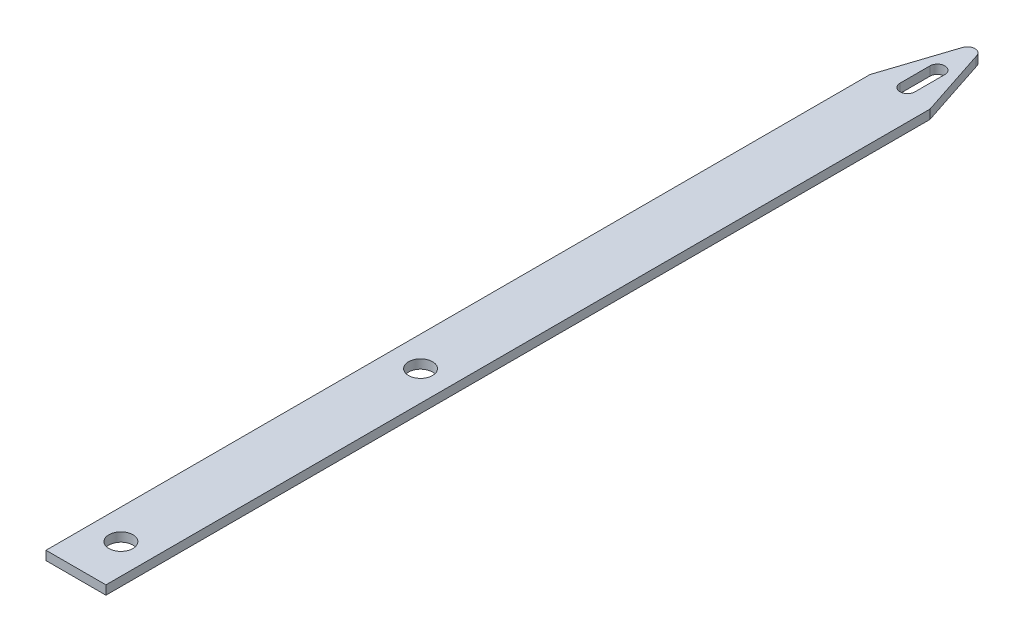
ISO-10303-21;
HEADER;
FILE_DESCRIPTION(('STEP AP214'),'2;1');
FILE_NAME('part.step','',(''),(''),'','','');
FILE_SCHEMA(('AUTOMOTIVE_DESIGN { 1 0 10303 214 1 1 1 1 }'));
ENDSEC;
DATA;
#1=APPLICATION_CONTEXT('core data for automotive mechanical design processes');
#2=APPLICATION_PROTOCOL_DEFINITION('international standard','automotive_design',2000,#1);
#3=PRODUCT_CONTEXT('',#1,'mechanical');
#4=PRODUCT('Part','Part','',(#3));
#5=PRODUCT_RELATED_PRODUCT_CATEGORY('part','',(#4));
#6=PRODUCT_DEFINITION_FORMATION('','',#4);
#7=PRODUCT_DEFINITION_CONTEXT('part definition',#1,'design');
#8=PRODUCT_DEFINITION('design','',#6,#7);
#9=PRODUCT_DEFINITION_SHAPE('','',#8);
#10=(LENGTH_UNIT() NAMED_UNIT(*) SI_UNIT(.MILLI.,.METRE.));
#11=(NAMED_UNIT(*) PLANE_ANGLE_UNIT() SI_UNIT($,.RADIAN.));
#12=(NAMED_UNIT(*) SI_UNIT($,.STERADIAN.) SOLID_ANGLE_UNIT());
#13=UNCERTAINTY_MEASURE_WITH_UNIT(LENGTH_MEASURE(1.E-05),#10,'distance_accuracy_value','');
#14=(GEOMETRIC_REPRESENTATION_CONTEXT(3) GLOBAL_UNCERTAINTY_ASSIGNED_CONTEXT((#13)) GLOBAL_UNIT_ASSIGNED_CONTEXT((#10,
#11,#12)) REPRESENTATION_CONTEXT('',''));
#15=CARTESIAN_POINT('',(0.,0.,0.));
#16=DIRECTION('',(0.,0.,1.));
#17=DIRECTION('',(1.,0.,0.));
#18=AXIS2_PLACEMENT_3D('',#15,#16,#17);
#19=CARTESIAN_POINT('',(0.,0.6,-20.));
#20=DIRECTION('',(0.,1.,0.));
#21=DIRECTION('',(0.,0.,1.));
#22=AXIS2_PLACEMENT_3D('',#19,#20,#21);
#23=PLANE('',#22);
#24=CARTESIAN_POINT('',(2.,0.6,37.));
#25=DIRECTION('',(0.,1.,0.));
#26=DIRECTION('',(0.,0.,1.));
#27=AXIS2_PLACEMENT_3D('',#24,#25,#26);
#28=CIRCLE('',#27,0.800000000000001);
#29=CARTESIAN_POINT('',(2.,0.6,37.8));
#30=VERTEX_POINT('',#29);
#31=EDGE_CURVE('E212',#30,#30,#28,.T.);
#32=ORIENTED_EDGE('',*,*,#31,.F.);
#33=EDGE_LOOP('',(#32));
#34=FACE_BOUND('',#33,.T.);
#35=CARTESIAN_POINT('',(2.,0.6,-19.5));
#36=DIRECTION('',(0.,-1.,0.));
#37=DIRECTION('',(0.,0.,-1.));
#38=AXIS2_PLACEMENT_3D('',#35,#36,#37);
#39=CIRCLE('',#38,0.5);
#40=CARTESIAN_POINT('',(1.52483695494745,0.6,-19.6556280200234));
#41=VERTEX_POINT('',#40);
#42=CARTESIAN_POINT('',(2.4903123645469,0.6,-19.5979478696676));
#43=VERTEX_POINT('',#42);
#44=EDGE_CURVE('E253',#41,#43,#39,.T.);
#45=ORIENTED_EDGE('',*,*,#44,.F.);
#46=DIRECTION('',(-0.311256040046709,0.,0.950326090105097));
#47=VECTOR('',#46,1.);
#48=CARTESIAN_POINT('',(5.04754408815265,0.6,-30.4111478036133));
#49=LINE('',#48,#47);
#50=CARTESIAN_POINT('',(0.,0.6,-15.));
#51=VERTEX_POINT('',#50);
#52=EDGE_CURVE('E240',#41,#51,#49,.T.);
#53=ORIENTED_EDGE('',*,*,#52,.T.);
#54=DIRECTION('',(0.,0.,1.));
#55=VECTOR('',#54,1.);
#56=CARTESIAN_POINT('',(0.,0.6,-20.));
#57=LINE('',#56,#55);
#58=CARTESIAN_POINT('',(0.,0.6,40.));
#59=VERTEX_POINT('',#58);
#60=EDGE_CURVE('E12',#51,#59,#57,.T.);
#61=ORIENTED_EDGE('',*,*,#60,.T.);
#62=DIRECTION('',(-1.,0.,0.));
#63=VECTOR('',#62,1.);
#64=CARTESIAN_POINT('',(0.,0.6,40.));
#65=LINE('',#64,#63);
#66=CARTESIAN_POINT('',(4.,0.6,40.));
#67=VERTEX_POINT('',#66);
#68=EDGE_CURVE('E208',#67,#59,#65,.T.);
#69=ORIENTED_EDGE('',*,*,#68,.F.);
#70=DIRECTION('',(0.,0.,1.));
#71=VECTOR('',#70,1.);
#72=CARTESIAN_POINT('',(4.,0.6,-20.));
#73=LINE('',#72,#71);
#74=CARTESIAN_POINT('',(4.,0.6,-15.));
#75=VERTEX_POINT('',#74);
#76=EDGE_CURVE('E114',#75,#67,#73,.T.);
#77=ORIENTED_EDGE('',*,*,#76,.F.);
#78=DIRECTION('',(0.311954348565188,0.,0.95009709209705));
#79=VECTOR('',#78,1.);
#80=CARTESIAN_POINT('',(-1.05813179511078,0.6,-30.405190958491));
#81=LINE('',#80,#79);
#82=EDGE_CURVE('E258',#43,#75,#81,.T.);
#83=ORIENTED_EDGE('',*,*,#82,.F.);
#84=EDGE_LOOP('',(#45,#53,#61,#69,#77,#83));
#85=FACE_BOUND('',#84,.T.);
#86=CARTESIAN_POINT('',(2.,0.6,17.));
#87=DIRECTION('',(0.,-1.,0.));
#88=DIRECTION('',(0.,0.,-1.));
#89=AXIS2_PLACEMENT_3D('',#86,#87,#88);
#90=CIRCLE('',#89,0.799999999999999);
#91=CARTESIAN_POINT('',(2.,0.6,16.2));
#92=VERTEX_POINT('',#91);
#93=EDGE_CURVE('E267',#92,#92,#90,.T.);
#94=ORIENTED_EDGE('',*,*,#93,.T.);
#95=EDGE_LOOP('',(#94));
#96=FACE_BOUND('',#95,.T.);
#97=DIRECTION('',(0.,0.,1.));
#98=VECTOR('',#97,1.);
#99=CARTESIAN_POINT('',(2.5,0.6,-31.4092962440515));
#100=LINE('',#99,#98);
#101=CARTESIAN_POINT('',(2.5,0.6,-17.5));
#102=VERTEX_POINT('',#101);
#103=CARTESIAN_POINT('',(2.5,0.6,-15.5));
#104=VERTEX_POINT('',#103);
#105=EDGE_CURVE('E230',#102,#104,#100,.T.);
#106=ORIENTED_EDGE('',*,*,#105,.T.);
#107=CARTESIAN_POINT('',(2.,0.6,-15.5));
#108=DIRECTION('',(0.,-1.,0.));
#109=DIRECTION('',(0.,0.,-1.));
#110=AXIS2_PLACEMENT_3D('',#107,#108,#109);
#111=CIRCLE('',#110,0.5);
#112=CARTESIAN_POINT('',(1.5,0.6,-15.5));
#113=VERTEX_POINT('',#112);
#114=EDGE_CURVE('E122',#104,#113,#111,.T.);
#115=ORIENTED_EDGE('',*,*,#114,.T.);
#116=DIRECTION('',(0.,0.,1.));
#117=VECTOR('',#116,1.);
#118=CARTESIAN_POINT('',(1.5,0.6,-31.4092962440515));
#119=LINE('',#118,#117);
#120=CARTESIAN_POINT('',(1.5,0.6,-17.5));
#121=VERTEX_POINT('',#120);
#122=EDGE_CURVE('E221',#121,#113,#119,.T.);
#123=ORIENTED_EDGE('',*,*,#122,.F.);
#124=CARTESIAN_POINT('',(2.,0.6,-17.5));
#125=DIRECTION('',(0.,-1.,0.));
#126=DIRECTION('',(0.,0.,-1.));
#127=AXIS2_PLACEMENT_3D('',#124,#125,#126);
#128=CIRCLE('',#127,0.5);
#129=EDGE_CURVE('E233',#121,#102,#128,.T.);
#130=ORIENTED_EDGE('',*,*,#129,.T.);
#131=EDGE_LOOP('',(#106,#115,#123,#130));
#132=FACE_BOUND('',#131,.T.);
#133=ADVANCED_FACE('F105',(#34,#85,#96,#132),#23,.T.);
#134=CARTESIAN_POINT('',(0.,0.,-20.));
#135=DIRECTION('',(0.,-1.,0.));
#136=DIRECTION('',(0.,0.,-1.));
#137=AXIS2_PLACEMENT_3D('',#134,#135,#136);
#138=PLANE('',#137);
#139=CARTESIAN_POINT('',(2.,0.,37.));
#140=DIRECTION('',(0.,1.,0.));
#141=DIRECTION('',(0.,0.,1.));
#142=AXIS2_PLACEMENT_3D('',#139,#140,#141);
#143=CIRCLE('',#142,0.800000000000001);
#144=CARTESIAN_POINT('',(2.,0.,37.8));
#145=VERTEX_POINT('',#144);
#146=EDGE_CURVE('E209',#145,#145,#143,.T.);
#147=ORIENTED_EDGE('',*,*,#146,.T.);
#148=EDGE_LOOP('',(#147));
#149=FACE_BOUND('',#148,.T.);
#150=DIRECTION('',(0.,0.,1.));
#151=VECTOR('',#150,1.);
#152=CARTESIAN_POINT('',(0.,0.,-20.));
#153=LINE('',#152,#151);
#154=CARTESIAN_POINT('',(0.,0.,-15.));
#155=VERTEX_POINT('',#154);
#156=CARTESIAN_POINT('',(0.,0.,40.));
#157=VERTEX_POINT('',#156);
#158=EDGE_CURVE('E109',#155,#157,#153,.T.);
#159=ORIENTED_EDGE('',*,*,#158,.F.);
#160=DIRECTION('',(-0.311256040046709,0.,0.950326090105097));
#161=VECTOR('',#160,1.);
#162=CARTESIAN_POINT('',(5.04754408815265,0.,-30.4111478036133));
#163=LINE('',#162,#161);
#164=CARTESIAN_POINT('',(1.52483695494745,0.,-19.6556280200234));
#165=VERTEX_POINT('',#164);
#166=EDGE_CURVE('E249',#165,#155,#163,.T.);
#167=ORIENTED_EDGE('',*,*,#166,.F.);
#168=CARTESIAN_POINT('',(2.,0.,-19.5));
#169=DIRECTION('',(0.,-1.,0.));
#170=DIRECTION('',(0.,0.,-1.));
#171=AXIS2_PLACEMENT_3D('',#168,#169,#170);
#172=CIRCLE('',#171,0.5);
#173=CARTESIAN_POINT('',(2.4903123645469,0.,-19.5979478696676));
#174=VERTEX_POINT('',#173);
#175=EDGE_CURVE('E254',#165,#174,#172,.T.);
#176=ORIENTED_EDGE('',*,*,#175,.T.);
#177=DIRECTION('',(0.311954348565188,0.,0.95009709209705));
#178=VECTOR('',#177,1.);
#179=CARTESIAN_POINT('',(-1.05813179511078,0.,-30.405190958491));
#180=LINE('',#179,#178);
#181=CARTESIAN_POINT('',(4.,0.,-15.));
#182=VERTEX_POINT('',#181);
#183=EDGE_CURVE('E257',#174,#182,#180,.T.);
#184=ORIENTED_EDGE('',*,*,#183,.T.);
#185=DIRECTION('',(0.,0.,1.));
#186=VECTOR('',#185,1.);
#187=CARTESIAN_POINT('',(4.,0.,-20.));
#188=LINE('',#187,#186);
#189=CARTESIAN_POINT('',(4.,0.,40.));
#190=VERTEX_POINT('',#189);
#191=EDGE_CURVE('E192',#182,#190,#188,.T.);
#192=ORIENTED_EDGE('',*,*,#191,.T.);
#193=DIRECTION('',(1.,0.,0.));
#194=VECTOR('',#193,1.);
#195=CARTESIAN_POINT('',(0.,0.,40.));
#196=LINE('',#195,#194);
#197=EDGE_CURVE('E195',#157,#190,#196,.T.);
#198=ORIENTED_EDGE('',*,*,#197,.F.);
#199=EDGE_LOOP('',(#159,#167,#176,#184,#192,#198));
#200=FACE_BOUND('',#199,.T.);
#201=CARTESIAN_POINT('',(2.,0.,17.));
#202=DIRECTION('',(0.,-1.,0.));
#203=DIRECTION('',(0.,0.,-1.));
#204=AXIS2_PLACEMENT_3D('',#201,#202,#203);
#205=CIRCLE('',#204,0.799999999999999);
#206=CARTESIAN_POINT('',(2.,0.,16.2));
#207=VERTEX_POINT('',#206);
#208=EDGE_CURVE('E193',#207,#207,#205,.T.);
#209=ORIENTED_EDGE('',*,*,#208,.F.);
#210=EDGE_LOOP('',(#209));
#211=FACE_BOUND('',#210,.T.);
#212=DIRECTION('',(0.,0.,1.));
#213=VECTOR('',#212,1.);
#214=CARTESIAN_POINT('',(1.5,0.,-31.4092962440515));
#215=LINE('',#214,#213);
#216=CARTESIAN_POINT('',(1.5,0.,-17.5));
#217=VERTEX_POINT('',#216);
#218=CARTESIAN_POINT('',(1.5,0.,-15.5));
#219=VERTEX_POINT('',#218);
#220=EDGE_CURVE('E225',#217,#219,#215,.T.);
#221=ORIENTED_EDGE('',*,*,#220,.T.);
#222=CARTESIAN_POINT('',(2.,0.,-15.5));
#223=DIRECTION('',(0.,-1.,0.));
#224=DIRECTION('',(0.,0.,-1.));
#225=AXIS2_PLACEMENT_3D('',#222,#223,#224);
#226=CIRCLE('',#225,0.5);
#227=CARTESIAN_POINT('',(2.5,0.,-15.5));
#228=VERTEX_POINT('',#227);
#229=EDGE_CURVE('E218',#228,#219,#226,.T.);
#230=ORIENTED_EDGE('',*,*,#229,.F.);
#231=DIRECTION('',(0.,0.,1.));
#232=VECTOR('',#231,1.);
#233=CARTESIAN_POINT('',(2.5,0.,-31.4092962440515));
#234=LINE('',#233,#232);
#235=CARTESIAN_POINT('',(2.5,0.,-17.5));
#236=VERTEX_POINT('',#235);
#237=EDGE_CURVE('E220',#236,#228,#234,.T.);
#238=ORIENTED_EDGE('',*,*,#237,.F.);
#239=CARTESIAN_POINT('',(2.,0.,-17.5));
#240=DIRECTION('',(0.,-1.,0.));
#241=DIRECTION('',(0.,0.,-1.));
#242=AXIS2_PLACEMENT_3D('',#239,#240,#241);
#243=CIRCLE('',#242,0.5);
#244=EDGE_CURVE('E223',#217,#236,#243,.T.);
#245=ORIENTED_EDGE('',*,*,#244,.F.);
#246=EDGE_LOOP('',(#221,#230,#238,#245));
#247=FACE_BOUND('',#246,.T.);
#248=ADVANCED_FACE('F196',(#149,#200,#211,#247),#138,.T.);
#249=CARTESIAN_POINT('',(0.,0.,-20.));
#250=DIRECTION('',(-1.,0.,0.));
#251=DIRECTION('',(0.,0.,1.));
#252=AXIS2_PLACEMENT_3D('',#249,#250,#251);
#253=PLANE('',#252);
#254=ORIENTED_EDGE('',*,*,#60,.F.);
#255=DIRECTION('',(0.,1.,0.));
#256=VECTOR('',#255,1.);
#257=CARTESIAN_POINT('',(0.,0.,-15.));
#258=LINE('',#257,#256);
#259=EDGE_CURVE('E189',#155,#51,#258,.T.);
#260=ORIENTED_EDGE('',*,*,#259,.F.);
#261=ORIENTED_EDGE('',*,*,#158,.T.);
#262=DIRECTION('',(0.,-1.,0.));
#263=VECTOR('',#262,1.);
#264=CARTESIAN_POINT('',(0.,0.6,40.));
#265=LINE('',#264,#263);
#266=EDGE_CURVE('E188',#59,#157,#265,.T.);
#267=ORIENTED_EDGE('',*,*,#266,.F.);
#268=EDGE_LOOP('',(#254,#260,#261,#267));
#269=FACE_BOUND('',#268,.T.);
#270=ADVANCED_FACE('F107',(#269),#253,.T.);
#271=CARTESIAN_POINT('',(4.,0.,-20.));
#272=DIRECTION('',(1.,0.,0.));
#273=DIRECTION('',(0.,0.,-1.));
#274=AXIS2_PLACEMENT_3D('',#271,#272,#273);
#275=PLANE('',#274);
#276=DIRECTION('',(0.,1.,0.));
#277=VECTOR('',#276,1.);
#278=CARTESIAN_POINT('',(4.,0.,-15.));
#279=LINE('',#278,#277);
#280=EDGE_CURVE('E264',#182,#75,#279,.T.);
#281=ORIENTED_EDGE('',*,*,#280,.T.);
#282=ORIENTED_EDGE('',*,*,#76,.T.);
#283=DIRECTION('',(0.,1.,0.));
#284=VECTOR('',#283,1.);
#285=CARTESIAN_POINT('',(4.,0.6,40.));
#286=LINE('',#285,#284);
#287=EDGE_CURVE('E203',#190,#67,#286,.T.);
#288=ORIENTED_EDGE('',*,*,#287,.F.);
#289=ORIENTED_EDGE('',*,*,#191,.F.);
#290=EDGE_LOOP('',(#281,#282,#288,#289));
#291=FACE_BOUND('',#290,.T.);
#292=ADVANCED_FACE('F275',(#291),#275,.T.);
#293=CARTESIAN_POINT('',(2.,0.,17.));
#294=DIRECTION('',(0.,1.,0.));
#295=DIRECTION('',(0.,0.,1.));
#296=AXIS2_PLACEMENT_3D('',#293,#294,#295);
#297=CYLINDRICAL_SURFACE('',#296,0.799999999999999);
#298=ORIENTED_EDGE('',*,*,#208,.T.);
#299=EDGE_LOOP('',(#298));
#300=FACE_BOUND('',#299,.T.);
#301=ORIENTED_EDGE('',*,*,#93,.F.);
#302=EDGE_LOOP('',(#301));
#303=FACE_BOUND('',#302,.T.);
#304=ADVANCED_FACE('F289',(#300,#303),#297,.F.);
#305=CARTESIAN_POINT('',(-1.05813179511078,0.,-30.405190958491));
#306=DIRECTION('',(-0.950097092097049,0.,0.311954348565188));
#307=DIRECTION('',(0.311954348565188,0.,0.95009709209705));
#308=AXIS2_PLACEMENT_3D('',#305,#306,#307);
#309=PLANE('',#308);
#310=ORIENTED_EDGE('',*,*,#82,.T.);
#311=ORIENTED_EDGE('',*,*,#280,.F.);
#312=ORIENTED_EDGE('',*,*,#183,.F.);
#313=DIRECTION('',(0.,1.,0.));
#314=VECTOR('',#313,1.);
#315=CARTESIAN_POINT('',(2.4903123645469,0.,-19.5979478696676));
#316=LINE('',#315,#314);
#317=EDGE_CURVE('E260',#174,#43,#316,.T.);
#318=ORIENTED_EDGE('',*,*,#317,.T.);
#319=EDGE_LOOP('',(#310,#311,#312,#318));
#320=FACE_BOUND('',#319,.T.);
#321=ADVANCED_FACE('F287',(#320),#309,.F.);
#322=CARTESIAN_POINT('',(2.,0.,-19.5));
#323=DIRECTION('',(0.,1.,0.));
#324=DIRECTION('',(0.,0.,1.));
#325=AXIS2_PLACEMENT_3D('',#322,#323,#324);
#326=CYLINDRICAL_SURFACE('',#325,0.5);
#327=ORIENTED_EDGE('',*,*,#44,.T.);
#328=ORIENTED_EDGE('',*,*,#317,.F.);
#329=ORIENTED_EDGE('',*,*,#175,.F.);
#330=DIRECTION('',(0.,1.,0.));
#331=VECTOR('',#330,1.);
#332=CARTESIAN_POINT('',(1.52483695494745,0.,-19.6556280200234));
#333=LINE('',#332,#331);
#334=EDGE_CURVE('E245',#165,#41,#333,.T.);
#335=ORIENTED_EDGE('',*,*,#334,.T.);
#336=EDGE_LOOP('',(#327,#328,#329,#335));
#337=FACE_BOUND('',#336,.T.);
#338=ADVANCED_FACE('F285',(#337),#326,.T.);
#339=CARTESIAN_POINT('',(5.04754408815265,0.,-30.4111478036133));
#340=DIRECTION('',(-0.950326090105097,0.,-0.311256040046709));
#341=DIRECTION('',(-0.311256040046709,0.,0.950326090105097));
#342=AXIS2_PLACEMENT_3D('',#339,#340,#341);
#343=PLANE('',#342);
#344=ORIENTED_EDGE('',*,*,#52,.F.);
#345=ORIENTED_EDGE('',*,*,#334,.F.);
#346=ORIENTED_EDGE('',*,*,#166,.T.);
#347=ORIENTED_EDGE('',*,*,#259,.T.);
#348=EDGE_LOOP('',(#344,#345,#346,#347));
#349=FACE_BOUND('',#348,.T.);
#350=ADVANCED_FACE('F282',(#349),#343,.T.);
#351=CARTESIAN_POINT('',(2.,0.,-15.5));
#352=DIRECTION('',(0.,1.,0.));
#353=DIRECTION('',(0.,0.,1.));
#354=AXIS2_PLACEMENT_3D('',#351,#352,#353);
#355=CYLINDRICAL_SURFACE('',#354,0.5);
#356=ORIENTED_EDGE('',*,*,#114,.F.);
#357=DIRECTION('',(0.,1.,0.));
#358=VECTOR('',#357,1.);
#359=CARTESIAN_POINT('',(2.5,0.,-15.5));
#360=LINE('',#359,#358);
#361=EDGE_CURVE('E228',#228,#104,#360,.T.);
#362=ORIENTED_EDGE('',*,*,#361,.F.);
#363=ORIENTED_EDGE('',*,*,#229,.T.);
#364=DIRECTION('',(0.,1.,0.));
#365=VECTOR('',#364,1.);
#366=CARTESIAN_POINT('',(1.5,0.,-15.5));
#367=LINE('',#366,#365);
#368=EDGE_CURVE('E238',#219,#113,#367,.T.);
#369=ORIENTED_EDGE('',*,*,#368,.T.);
#370=EDGE_LOOP('',(#356,#362,#363,#369));
#371=FACE_BOUND('',#370,.T.);
#372=ADVANCED_FACE('F361',(#371),#355,.F.);
#373=CARTESIAN_POINT('',(1.5,0.,-31.4092962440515));
#374=DIRECTION('',(-1.,0.,0.));
#375=DIRECTION('',(0.,0.,1.));
#376=AXIS2_PLACEMENT_3D('',#373,#374,#375);
#377=PLANE('',#376);
#378=ORIENTED_EDGE('',*,*,#122,.T.);
#379=ORIENTED_EDGE('',*,*,#368,.F.);
#380=ORIENTED_EDGE('',*,*,#220,.F.);
#381=DIRECTION('',(0.,1.,0.));
#382=VECTOR('',#381,1.);
#383=CARTESIAN_POINT('',(1.5,0.,-17.5));
#384=LINE('',#383,#382);
#385=EDGE_CURVE('E241',#217,#121,#384,.T.);
#386=ORIENTED_EDGE('',*,*,#385,.T.);
#387=EDGE_LOOP('',(#378,#379,#380,#386));
#388=FACE_BOUND('',#387,.T.);
#389=ADVANCED_FACE('F353',(#388),#377,.F.);
#390=CARTESIAN_POINT('',(2.,0.,-17.5));
#391=DIRECTION('',(0.,1.,0.));
#392=DIRECTION('',(0.,0.,1.));
#393=AXIS2_PLACEMENT_3D('',#390,#391,#392);
#394=CYLINDRICAL_SURFACE('',#393,0.5);
#395=ORIENTED_EDGE('',*,*,#129,.F.);
#396=ORIENTED_EDGE('',*,*,#385,.F.);
#397=ORIENTED_EDGE('',*,*,#244,.T.);
#398=DIRECTION('',(0.,1.,0.));
#399=VECTOR('',#398,1.);
#400=CARTESIAN_POINT('',(2.5,0.,-17.5));
#401=LINE('',#400,#399);
#402=EDGE_CURVE('E130',#236,#102,#401,.T.);
#403=ORIENTED_EDGE('',*,*,#402,.T.);
#404=EDGE_LOOP('',(#395,#396,#397,#403));
#405=FACE_BOUND('',#404,.T.);
#406=ADVANCED_FACE('F346',(#405),#394,.F.);
#407=CARTESIAN_POINT('',(2.5,0.,-31.4092962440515));
#408=DIRECTION('',(-1.,0.,0.));
#409=DIRECTION('',(0.,0.,1.));
#410=AXIS2_PLACEMENT_3D('',#407,#408,#409);
#411=PLANE('',#410);
#412=ORIENTED_EDGE('',*,*,#105,.F.);
#413=ORIENTED_EDGE('',*,*,#402,.F.);
#414=ORIENTED_EDGE('',*,*,#237,.T.);
#415=ORIENTED_EDGE('',*,*,#361,.T.);
#416=EDGE_LOOP('',(#412,#413,#414,#415));
#417=FACE_BOUND('',#416,.T.);
#418=ADVANCED_FACE('F341',(#417),#411,.T.);
#419=CARTESIAN_POINT('',(0.,0.,40.));
#420=DIRECTION('',(0.,0.,1.));
#421=DIRECTION('',(1.,0.,0.));
#422=AXIS2_PLACEMENT_3D('',#419,#420,#421);
#423=PLANE('',#422);
#424=ORIENTED_EDGE('',*,*,#266,.T.);
#425=ORIENTED_EDGE('',*,*,#197,.T.);
#426=ORIENTED_EDGE('',*,*,#287,.T.);
#427=ORIENTED_EDGE('',*,*,#68,.T.);
#428=EDGE_LOOP('',(#424,#425,#426,#427));
#429=FACE_BOUND('',#428,.T.);
#430=ADVANCED_FACE('F206',(#429),#423,.T.);
#431=CARTESIAN_POINT('',(2.,0.,37.));
#432=DIRECTION('',(0.,1.,0.));
#433=DIRECTION('',(0.,0.,1.));
#434=AXIS2_PLACEMENT_3D('',#431,#432,#433);
#435=CYLINDRICAL_SURFACE('',#434,0.800000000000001);
#436=ORIENTED_EDGE('',*,*,#146,.F.);
#437=EDGE_LOOP('',(#436));
#438=FACE_BOUND('',#437,.T.);
#439=ORIENTED_EDGE('',*,*,#31,.T.);
#440=EDGE_LOOP('',(#439));
#441=FACE_BOUND('',#440,.T.);
#442=ADVANCED_FACE('F328',(#438,#441),#435,.F.);
#443=CLOSED_SHELL('',(#133,#248,#270,#292,#304,#321,#338,#350,#372,#389,#406,#418,#430,#442));
#444=MANIFOLD_SOLID_BREP('B2',#443);
#445=ADVANCED_BREP_SHAPE_REPRESENTATION('',(#18,#444),#14);
#446=SHAPE_DEFINITION_REPRESENTATION(#9,#445);
ENDSEC;
END-ISO-10303-21;
